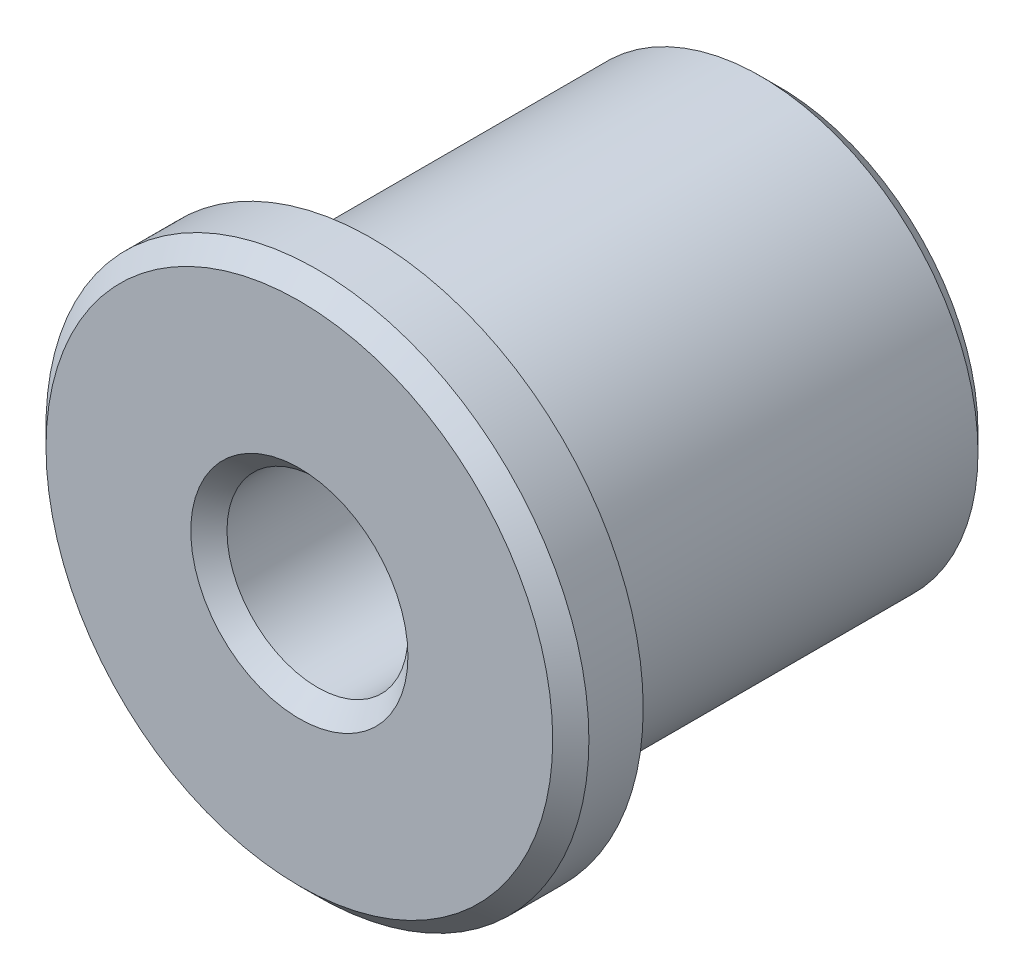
from build123d import *

# Parameters (mm, degrees)
ESQUISSE1_R        = 12
ESQUISSE1_R_2      = 5
BOSS_EXTRU_1_DEPTH = 22.5
ESQUISSE2_R        = 15
ESQUISSE2_R_2      = 5
BOSS_EXTRU_2_DEPTH = 4
CHANFREIN1_SIZE    = 1


with BuildPart() as part:
    # Esquisse1 → Boss.-Extru.1 (new body)
    with BuildSketch(Plane.XY):
        with Locations(Location((0, 0, 0), (0, 0, 180))):
            Circle(ESQUISSE1_R)
        with Locations(Location((0, 0, 0), (0, 0, 180))):
            Circle(ESQUISSE1_R_2, mode=Mode.SUBTRACT)
    extrude(amount=BOSS_EXTRU_1_DEPTH)

    # Esquisse2 → Boss.-Extru.2 (add)
    with BuildSketch(Plane.XY.offset(22.5)):
        Circle(ESQUISSE2_R)
        with Locations(Location((0, 0, 0), (0, 0, 180))):
            Circle(ESQUISSE2_R_2, mode=Mode.SUBTRACT)
    extrude(amount=BOSS_EXTRU_2_DEPTH)

    # Chanfrein1
    chanfrein1_edges = [part.edges().sort_by_distance(p)[0] for p in [
        (5, 0, 26.5),
        (12, 0, 0),
        (5, 0, 0),
        (-15, 0, 26.5),
    ]]
    chamfer(chanfrein1_edges, length=CHANFREIN1_SIZE)


solid = part.part
